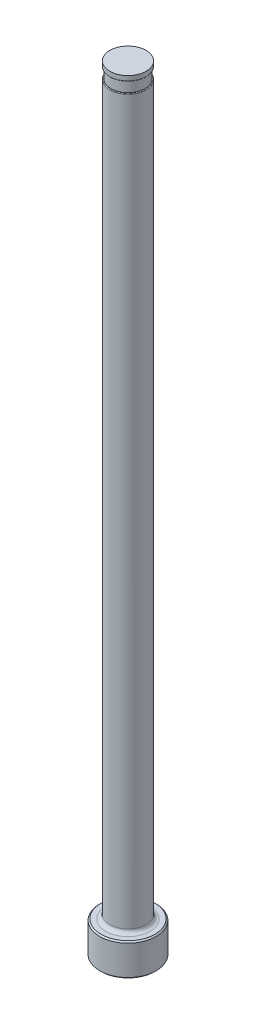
ISO-10303-21;
HEADER;
FILE_DESCRIPTION(('STEP AP214'),'2;1');
FILE_NAME('part.step','',(''),(''),'','','');
FILE_SCHEMA(('AUTOMOTIVE_DESIGN { 1 0 10303 214 1 1 1 1 }'));
ENDSEC;
DATA;
#1=APPLICATION_CONTEXT('core data for automotive mechanical design processes');
#2=APPLICATION_PROTOCOL_DEFINITION('international standard','automotive_design',2000,#1);
#3=PRODUCT_CONTEXT('',#1,'mechanical');
#4=PRODUCT('Part','Part','',(#3));
#5=PRODUCT_RELATED_PRODUCT_CATEGORY('part','',(#4));
#6=PRODUCT_DEFINITION_FORMATION('','',#4);
#7=PRODUCT_DEFINITION_CONTEXT('part definition',#1,'design');
#8=PRODUCT_DEFINITION('design','',#6,#7);
#9=PRODUCT_DEFINITION_SHAPE('','',#8);
#10=(LENGTH_UNIT() NAMED_UNIT(*) SI_UNIT(.MILLI.,.METRE.));
#11=(NAMED_UNIT(*) PLANE_ANGLE_UNIT() SI_UNIT($,.RADIAN.));
#12=(NAMED_UNIT(*) SI_UNIT($,.STERADIAN.) SOLID_ANGLE_UNIT());
#13=UNCERTAINTY_MEASURE_WITH_UNIT(LENGTH_MEASURE(1.E-05),#10,'distance_accuracy_value','');
#14=(GEOMETRIC_REPRESENTATION_CONTEXT(3) GLOBAL_UNCERTAINTY_ASSIGNED_CONTEXT((#13)) GLOBAL_UNIT_ASSIGNED_CONTEXT((#10,
#11,#12)) REPRESENTATION_CONTEXT('',''));
#15=CARTESIAN_POINT('',(0.,0.,0.));
#16=DIRECTION('',(0.,0.,1.));
#17=DIRECTION('',(1.,0.,0.));
#18=AXIS2_PLACEMENT_3D('',#15,#16,#17);
#19=CARTESIAN_POINT('',(-3.57123999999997,151.384,0.));
#20=DIRECTION('',(0.,1.,0.));
#21=DIRECTION('',(0.,0.,1.));
#22=AXIS2_PLACEMENT_3D('',#19,#20,#21);
#23=PLANE('',#22);
#24=CARTESIAN_POINT('',(0.,151.384,0.));
#25=DIRECTION('',(0.,1.,0.));
#26=DIRECTION('',(0.,0.,1.));
#27=AXIS2_PLACEMENT_3D('',#24,#25,#26);
#28=CIRCLE('',#27,3.43915999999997);
#29=CARTESIAN_POINT('',(0.,151.384,3.43915999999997));
#30=VERTEX_POINT('',#29);
#31=EDGE_CURVE('E11',#30,#30,#28,.F.);
#32=ORIENTED_EDGE('',*,*,#31,.T.);
#33=EDGE_LOOP('',(#32));
#34=FACE_BOUND('',#33,.T.);
#35=CARTESIAN_POINT('',(0.,151.384,0.));
#36=DIRECTION('',(0.,1.,0.));
#37=DIRECTION('',(0.,0.,1.));
#38=AXIS2_PLACEMENT_3D('',#35,#36,#37);
#39=CIRCLE('',#38,3.36803999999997);
#40=CARTESIAN_POINT('',(0.,151.384,3.36803999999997));
#41=VERTEX_POINT('',#40);
#42=EDGE_CURVE('E78',#41,#41,#39,.T.);
#43=ORIENTED_EDGE('',*,*,#42,.T.);
#44=EDGE_LOOP('',(#43));
#45=FACE_BOUND('',#44,.T.);
#46=ADVANCED_FACE('F36',(#34,#45),#23,.F.);
#47=CARTESIAN_POINT('',(0.,259.958771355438,0.));
#48=DIRECTION('',(0.,1.,0.));
#49=DIRECTION('',(0.,0.,1.));
#50=AXIS2_PLACEMENT_3D('',#47,#48,#49);
#51=CYLINDRICAL_SURFACE('',#50,3.57123999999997);
#52=DIRECTION('',(0.,1.,0.));
#53=VECTOR('',#52,1.);
#54=CARTESIAN_POINT('',(-3.36803999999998,259.958771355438,-1.18746018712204));
#55=LINE('',#54,#53);
#56=CARTESIAN_POINT('',(-3.36803999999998,149.225,-1.18746018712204));
#57=VERTEX_POINT('',#56);
#58=CARTESIAN_POINT('',(-3.36803999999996,86.868,-1.1874601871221));
#59=VERTEX_POINT('',#58);
#60=EDGE_CURVE('E73',#57,#59,#55,.F.);
#61=ORIENTED_EDGE('',*,*,#60,.F.);
#62=CARTESIAN_POINT('',(0.,149.225,0.));
#63=DIRECTION('',(0.,-1.,0.));
#64=DIRECTION('',(0.,0.,-1.));
#65=AXIS2_PLACEMENT_3D('',#62,#63,#64);
#66=CIRCLE('',#65,3.57123999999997);
#67=CARTESIAN_POINT('',(-3.36803999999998,149.225,1.18746018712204));
#68=VERTEX_POINT('',#67);
#69=EDGE_CURVE('E51',#57,#68,#66,.T.);
#70=ORIENTED_EDGE('',*,*,#69,.T.);
#71=DIRECTION('',(0.,1.,0.));
#72=VECTOR('',#71,1.);
#73=CARTESIAN_POINT('',(-3.36803999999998,259.958771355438,1.18746018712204));
#74=LINE('',#73,#72);
#75=CARTESIAN_POINT('',(-3.36803999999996,86.868,1.18746018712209));
#76=VERTEX_POINT('',#75);
#77=EDGE_CURVE('E84',#76,#68,#74,.T.);
#78=ORIENTED_EDGE('',*,*,#77,.F.);
#79=CARTESIAN_POINT('',(-3.36803999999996,86.868,-1.1874601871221));
#80=CARTESIAN_POINT('',(-3.3680377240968,86.8376283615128,-1.18745959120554));
#81=CARTESIAN_POINT('',(-3.36847634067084,86.80727189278,-1.18622334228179));
#82=CARTESIAN_POINT('',(-3.37021067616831,86.7467876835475,-1.18128966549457));
#83=CARTESIAN_POINT('',(-3.37150629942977,86.7166599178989,-1.1775925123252));
#84=CARTESIAN_POINT('',(-3.37663245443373,86.6270705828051,-1.16285138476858));
#85=CARTESIAN_POINT('',(-3.38170254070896,86.5682347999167,-1.14815759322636));
#86=CARTESIAN_POINT('',(-3.39461112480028,86.4540784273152,-1.10940606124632));
#87=CARTESIAN_POINT('',(-3.40245035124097,86.3987587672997,-1.08534585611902));
#88=CARTESIAN_POINT('',(-3.42005737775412,86.2931328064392,-1.02851526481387));
#89=CARTESIAN_POINT('',(-3.42982508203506,86.2428262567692,-0.995745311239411));
#90=CARTESIAN_POINT('',(-3.45028756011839,86.1483803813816,-0.922345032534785));
#91=CARTESIAN_POINT('',(-3.4609842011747,86.1042539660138,-0.881698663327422));
#92=CARTESIAN_POINT('',(-3.482209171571,86.0231926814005,-0.793737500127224));
#93=CARTESIAN_POINT('',(-3.49273745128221,85.9862598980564,-0.746420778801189));
#94=CARTESIAN_POINT('',(-3.51307583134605,85.9186585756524,-0.644120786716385));
#95=CARTESIAN_POINT('',(-3.52283072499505,85.8883557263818,-0.58888518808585));
#96=CARTESIAN_POINT('',(-3.54010786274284,85.8366078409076,-0.474091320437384));
#97=CARTESIAN_POINT('',(-3.54762954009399,85.8151650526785,-0.414531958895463));
#98=CARTESIAN_POINT('',(-3.56012114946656,85.7802555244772,-0.288969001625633));
#99=CARTESIAN_POINT('',(-3.56491124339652,85.7673434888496,-0.222793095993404));
#100=CARTESIAN_POINT('',(-3.57075657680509,85.751655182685,-0.089080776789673));
#101=CARTESIAN_POINT('',(-3.57181063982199,85.748882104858,-0.0215439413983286));
#102=CARTESIAN_POINT('',(-3.57004535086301,85.7535778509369,0.115996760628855));
#103=CARTESIAN_POINT('',(-3.56706025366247,85.761484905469,0.185984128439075));
#104=CARTESIAN_POINT('',(-3.55722219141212,85.7883152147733,0.323545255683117));
#105=CARTESIAN_POINT('',(-3.55036911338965,85.8072387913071,0.39111894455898));
#106=CARTESIAN_POINT('',(-3.53356592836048,85.8558994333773,0.521506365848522));
#107=CARTESIAN_POINT('',(-3.52363012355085,85.8855866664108,0.584340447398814));
#108=CARTESIAN_POINT('',(-3.50178692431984,85.955455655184,0.703501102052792));
#109=CARTESIAN_POINT('',(-3.4898802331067,85.9956336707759,0.759829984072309));
#110=CARTESIAN_POINT('',(-3.46618365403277,86.0834388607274,0.861343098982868));
#111=CARTESIAN_POINT('',(-3.45441819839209,86.1305877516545,0.906946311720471));
#112=CARTESIAN_POINT('',(-3.4318469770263,86.2325334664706,0.988936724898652));
#113=CARTESIAN_POINT('',(-3.42104103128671,86.2873288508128,1.02532565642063));
#114=CARTESIAN_POINT('',(-3.40231953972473,86.3994535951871,1.08578170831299));
#115=CARTESIAN_POINT('',(-3.3942694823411,86.4564337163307,1.11045708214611));
#116=CARTESIAN_POINT('',(-3.38112795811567,86.5740270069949,1.14985485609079));
#117=CARTESIAN_POINT('',(-3.37603276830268,86.6346354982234,1.16458978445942));
#118=CARTESIAN_POINT('',(-3.37115526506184,86.7245050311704,1.17859463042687));
#119=CARTESIAN_POINT('',(-3.36998926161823,86.7531157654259,1.18192009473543));
#120=CARTESIAN_POINT('',(-3.36843159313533,86.8104795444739,1.18635035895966));
#121=CARTESIAN_POINT('',(-3.36803858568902,86.8392322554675,1.18745900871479));
#122=CARTESIAN_POINT('',(-3.36803999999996,86.868,1.1874601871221));
#123=B_SPLINE_CURVE_WITH_KNOTS('',3,(#79,#80,#81,#82,#83,#84,#85,#86,#87,#88,#89,#90,#91,#92,
#93,#94,#95,#96,#97,#98,#99,#100,#101,#102,#103,#104,#105,#106,#107,#108,#109,#110,#111,#112,
#113,#114,#115,#116,#117,#118,#119,#120,#121,#122),.UNSPECIFIED.,.F.,.F.,(4,2,2,2,2,2,2,2,2,2,2,
2,2,2,2,2,2,2,2,2,2,4),(0.,0.0910565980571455,0.182103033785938,0.363698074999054,
0.545340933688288,0.726974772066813,0.908982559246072,1.09104304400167,1.28146671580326,
1.4719386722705,1.67381993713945,1.8757647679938,2.08625256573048,2.29674651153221,
2.5062781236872,2.71573513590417,2.9146211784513,3.11346982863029,3.30038893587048,
3.48707202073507,3.57347157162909,3.65972094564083),.UNSPECIFIED.);
#124=EDGE_CURVE('E81',#59,#76,#123,.T.);
#125=ORIENTED_EDGE('',*,*,#124,.F.);
#126=EDGE_LOOP('',(#61,#70,#78,#125));
#127=FACE_BOUND('',#126,.T.);
#128=CARTESIAN_POINT('',(0.,7.11200000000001,0.));
#129=DIRECTION('',(0.,1.,0.));
#130=DIRECTION('',(0.,0.,1.));
#131=AXIS2_PLACEMENT_3D('',#128,#129,#130);
#132=CIRCLE('',#131,3.57123999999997);
#133=CARTESIAN_POINT('',(0.,7.11200000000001,3.57123999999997));
#134=VERTEX_POINT('',#133);
#135=EDGE_CURVE('E116',#134,#134,#132,.T.);
#136=ORIENTED_EDGE('',*,*,#135,.T.);
#137=EDGE_LOOP('',(#136));
#138=FACE_BOUND('',#137,.T.);
#139=ADVANCED_FACE('F82',(#127,#138),#51,.T.);
#140=CARTESIAN_POINT('',(0.,0.,0.));
#141=DIRECTION('',(0.,-1.,0.));
#142=DIRECTION('',(0.,0.,-1.));
#143=AXIS2_PLACEMENT_3D('',#140,#141,#142);
#144=PLANE('',#143);
#145=CARTESIAN_POINT('',(0.,0.,0.));
#146=DIRECTION('',(0.,-1.,0.));
#147=DIRECTION('',(0.,0.,-1.));
#148=AXIS2_PLACEMENT_3D('',#145,#146,#147);
#149=CIRCLE('',#148,5.29589999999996);
#150=CARTESIAN_POINT('',(0.,0.,-5.29589999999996));
#151=VERTEX_POINT('',#150);
#152=EDGE_CURVE('E113',#151,#151,#149,.T.);
#153=ORIENTED_EDGE('',*,*,#152,.T.);
#154=EDGE_LOOP('',(#153));
#155=FACE_BOUND('',#154,.T.);
#156=ADVANCED_FACE('F192',(#155),#144,.T.);
#157=CARTESIAN_POINT('',(0.,259.958771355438,0.));
#158=DIRECTION('',(0.,1.,0.));
#159=DIRECTION('',(0.,0.,1.));
#160=AXIS2_PLACEMENT_3D('',#157,#158,#159);
#161=CYLINDRICAL_SURFACE('',#160,5.54989999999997);
#162=CARTESIAN_POINT('',(0.,6.09599999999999,0.));
#163=DIRECTION('',(0.,1.,0.));
#164=DIRECTION('',(0.,0.,1.));
#165=AXIS2_PLACEMENT_3D('',#162,#163,#164);
#166=CIRCLE('',#165,5.54989999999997);
#167=CARTESIAN_POINT('',(0.,6.09599999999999,5.54989999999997));
#168=VERTEX_POINT('',#167);
#169=EDGE_CURVE('E110',#168,#168,#166,.F.);
#170=ORIENTED_EDGE('',*,*,#169,.T.);
#171=EDGE_LOOP('',(#170));
#172=FACE_BOUND('',#171,.T.);
#173=CARTESIAN_POINT('',(0.,0.253999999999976,0.));
#174=DIRECTION('',(0.,-1.,0.));
#175=DIRECTION('',(0.,0.,-1.));
#176=AXIS2_PLACEMENT_3D('',#173,#174,#175);
#177=CIRCLE('',#176,5.54989999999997);
#178=CARTESIAN_POINT('',(0.,0.253999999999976,-5.54989999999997));
#179=VERTEX_POINT('',#178);
#180=EDGE_CURVE('E107',#179,#179,#177,.F.);
#181=ORIENTED_EDGE('',*,*,#180,.T.);
#182=EDGE_LOOP('',(#181));
#183=FACE_BOUND('',#182,.T.);
#184=ADVANCED_FACE('F195',(#172,#183),#161,.T.);
#185=CARTESIAN_POINT('',(-5.54989999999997,6.35,0.));
#186=DIRECTION('',(0.,1.,0.));
#187=DIRECTION('',(0.,0.,1.));
#188=AXIS2_PLACEMENT_3D('',#185,#186,#187);
#189=PLANE('',#188);
#190=CARTESIAN_POINT('',(0.,6.35,0.));
#191=DIRECTION('',(0.,1.,0.));
#192=DIRECTION('',(0.,0.,1.));
#193=AXIS2_PLACEMENT_3D('',#190,#191,#192);
#194=CIRCLE('',#193,4.33323999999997);
#195=CARTESIAN_POINT('',(0.,6.35,4.33323999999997));
#196=VERTEX_POINT('',#195);
#197=EDGE_CURVE('E87',#196,#196,#194,.F.);
#198=ORIENTED_EDGE('',*,*,#197,.T.);
#199=EDGE_LOOP('',(#198));
#200=FACE_BOUND('',#199,.T.);
#201=CARTESIAN_POINT('',(0.,6.35,0.));
#202=DIRECTION('',(0.,1.,0.));
#203=DIRECTION('',(0.,0.,1.));
#204=AXIS2_PLACEMENT_3D('',#201,#202,#203);
#205=CIRCLE('',#204,5.29589999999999);
#206=CARTESIAN_POINT('',(0.,6.35,5.29589999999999));
#207=VERTEX_POINT('',#206);
#208=EDGE_CURVE('E104',#207,#207,#205,.T.);
#209=ORIENTED_EDGE('',*,*,#208,.T.);
#210=EDGE_LOOP('',(#209));
#211=FACE_BOUND('',#210,.T.);
#212=ADVANCED_FACE('F190',(#200,#211),#189,.T.);
#213=CARTESIAN_POINT('',(0.,6.35000000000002,0.));
#214=DIRECTION('',(0.,-1.,0.));
#215=DIRECTION('',(0.,0.,-1.));
#216=AXIS2_PLACEMENT_3D('',#213,#214,#215);
#217=CONICAL_SURFACE('',#216,5.29589999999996,0.785398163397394);
#218=ORIENTED_EDGE('',*,*,#169,.F.);
#219=EDGE_LOOP('',(#218));
#220=FACE_BOUND('',#219,.T.);
#221=ORIENTED_EDGE('',*,*,#208,.F.);
#222=EDGE_LOOP('',(#221));
#223=FACE_BOUND('',#222,.T.);
#224=ADVANCED_FACE('F186',(#220,#223),#217,.T.);
#225=CARTESIAN_POINT('',(0.,0.253999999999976,0.));
#226=DIRECTION('',(0.,1.,0.));
#227=DIRECTION('',(0.,0.,1.));
#228=AXIS2_PLACEMENT_3D('',#225,#226,#227);
#229=CONICAL_SURFACE('',#228,5.54989999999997,0.785398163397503);
#230=ORIENTED_EDGE('',*,*,#152,.F.);
#231=EDGE_LOOP('',(#230));
#232=FACE_BOUND('',#231,.T.);
#233=ORIENTED_EDGE('',*,*,#180,.F.);
#234=EDGE_LOOP('',(#233));
#235=FACE_BOUND('',#234,.T.);
#236=ADVANCED_FACE('F182',(#232,#235),#229,.T.);
#237=CARTESIAN_POINT('',(0.,7.11200000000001,0.));
#238=DIRECTION('',(0.,1.,0.));
#239=DIRECTION('',(0.,0.,1.));
#240=AXIS2_PLACEMENT_3D('',#237,#238,#239);
#241=TOROIDAL_SURFACE('',#240,4.33323999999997,0.762);
#242=ORIENTED_EDGE('',*,*,#197,.F.);
#243=EDGE_LOOP('',(#242));
#244=FACE_BOUND('',#243,.T.);
#245=ORIENTED_EDGE('',*,*,#135,.F.);
#246=EDGE_LOOP('',(#245));
#247=FACE_BOUND('',#246,.T.);
#248=ADVANCED_FACE('F147',(#244,#247),#241,.F.);
#249=CARTESIAN_POINT('',(-3.57123999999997,149.352,0.));
#250=DIRECTION('',(0.,-1.,0.));
#251=DIRECTION('',(0.,0.,-1.));
#252=AXIS2_PLACEMENT_3D('',#249,#250,#251);
#253=PLANE('',#252);
#254=DIRECTION('',(0.,0.,1.));
#255=VECTOR('',#254,1.);
#256=CARTESIAN_POINT('',(-3.36803999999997,149.352,0.));
#257=LINE('',#256,#255);
#258=CARTESIAN_POINT('',(-3.36803999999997,149.352,0.));
#259=VERTEX_POINT('',#258);
#260=CARTESIAN_POINT('',(-3.36803999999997,149.352,0.720482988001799));
#261=VERTEX_POINT('',#260);
#262=EDGE_CURVE('E90',#259,#261,#257,.T.);
#263=ORIENTED_EDGE('',*,*,#262,.T.);
#264=CARTESIAN_POINT('',(0.,149.352,0.));
#265=DIRECTION('',(0.,-1.,0.));
#266=DIRECTION('',(0.,0.,-1.));
#267=AXIS2_PLACEMENT_3D('',#264,#265,#266);
#268=CIRCLE('',#267,3.44423999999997);
#269=CARTESIAN_POINT('',(-3.36803999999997,149.352,-0.720482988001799));
#270=VERTEX_POINT('',#269);
#271=EDGE_CURVE('E86',#261,#270,#268,.F.);
#272=ORIENTED_EDGE('',*,*,#271,.T.);
#273=EDGE_CURVE('E79',#270,#259,#257,.T.);
#274=ORIENTED_EDGE('',*,*,#273,.T.);
#275=CARTESIAN_POINT('',(0.,149.352,0.));
#276=DIRECTION('',(0.,1.,0.));
#277=DIRECTION('',(0.,0.,1.));
#278=AXIS2_PLACEMENT_3D('',#275,#276,#277);
#279=CIRCLE('',#278,3.36803999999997);
#280=EDGE_CURVE('E101',#259,#259,#279,.T.);
#281=ORIENTED_EDGE('',*,*,#280,.F.);
#282=EDGE_LOOP('',(#263,#272,#274,#281));
#283=FACE_BOUND('',#282,.T.);
#284=ADVANCED_FACE('F144',(#283),#253,.F.);
#285=CARTESIAN_POINT('',(0.,153.448281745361,0.));
#286=DIRECTION('',(0.,1.,0.));
#287=DIRECTION('',(0.,0.,1.));
#288=AXIS2_PLACEMENT_3D('',#285,#286,#287);
#289=CYLINDRICAL_SURFACE('',#288,3.36803999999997);
#290=ORIENTED_EDGE('',*,*,#42,.F.);
#291=EDGE_LOOP('',(#290));
#292=FACE_BOUND('',#291,.T.);
#293=ORIENTED_EDGE('',*,*,#280,.T.);
#294=EDGE_LOOP('',(#293));
#295=FACE_BOUND('',#294,.T.);
#296=ADVANCED_FACE('F141',(#292,#295),#289,.T.);
#297=CARTESIAN_POINT('',(-3.36803999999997,150.368,-5.54989999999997));
#298=DIRECTION('',(1.,0.,0.));
#299=DIRECTION('',(0.,1.,0.));
#300=AXIS2_PLACEMENT_3D('',#297,#298,#299);
#301=PLANE('',#300);
#302=ORIENTED_EDGE('',*,*,#273,.F.);
#303=CARTESIAN_POINT('',(-3.36803999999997,149.352,-0.720482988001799));
#304=CARTESIAN_POINT('',(-3.36803999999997,149.351993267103,-0.741667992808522));
#305=CARTESIAN_POINT('',(-3.36803999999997,149.351767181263,-0.762857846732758));
#306=CARTESIAN_POINT('',(-3.36803999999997,149.35071621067,-0.805256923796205));
#307=CARTESIAN_POINT('',(-3.36803999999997,149.349890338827,-0.826466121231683));
#308=CARTESIAN_POINT('',(-3.36803999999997,149.347476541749,-0.868880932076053));
#309=CARTESIAN_POINT('',(-3.36803999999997,149.345887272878,-0.890086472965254));
#310=CARTESIAN_POINT('',(-3.36803999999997,149.341714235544,-0.93239051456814));
#311=CARTESIAN_POINT('',(-3.36803999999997,149.339131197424,-0.953489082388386));
#312=CARTESIAN_POINT('',(-3.36803999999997,149.333919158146,-0.987044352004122));
#313=CARTESIAN_POINT('',(-3.36803999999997,149.331725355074,-0.999568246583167));
#314=CARTESIAN_POINT('',(-3.36803999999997,149.326729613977,-1.02450849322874));
#315=CARTESIAN_POINT('',(-3.36803999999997,149.32392716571,-1.03692474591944));
#316=CARTESIAN_POINT('',(-3.36803999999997,149.317430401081,-1.06198397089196));
#317=CARTESIAN_POINT('',(-3.36803999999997,149.313708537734,-1.07461988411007));
#318=CARTESIAN_POINT('',(-3.36803999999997,149.305125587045,-1.09949809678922));
#319=CARTESIAN_POINT('',(-3.36803999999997,149.300266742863,-1.1117411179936));
#320=CARTESIAN_POINT('',(-3.36803999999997,149.291811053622,-1.12921604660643));
#321=CARTESIAN_POINT('',(-3.36803999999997,149.28888164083,-1.13476833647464));
#322=CARTESIAN_POINT('',(-3.36803999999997,149.282508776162,-1.14558508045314));
#323=CARTESIAN_POINT('',(-3.36803999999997,149.279064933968,-1.15084931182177));
#324=CARTESIAN_POINT('',(-3.36803999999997,149.272291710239,-1.15984658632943));
#325=CARTESIAN_POINT('',(-3.36803999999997,149.269085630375,-1.1636712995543));
#326=CARTESIAN_POINT('',(-3.36803999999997,149.262150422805,-1.17081956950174));
#327=CARTESIAN_POINT('',(-3.36803999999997,149.258422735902,-1.1741444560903));
#328=CARTESIAN_POINT('',(-3.36803999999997,149.252066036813,-1.17872666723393));
#329=CARTESIAN_POINT('',(-3.36803999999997,149.249640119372,-1.1802633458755));
#330=CARTESIAN_POINT('',(-3.36803999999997,149.244593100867,-1.18295888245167));
#331=CARTESIAN_POINT('',(-3.36803999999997,149.241972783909,-1.18411916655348));
#332=CARTESIAN_POINT('',(-3.36803999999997,149.236986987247,-1.18581641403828));
#333=CARTESIAN_POINT('',(-3.36803999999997,149.234645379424,-1.18642231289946));
#334=CARTESIAN_POINT('',(-3.36803999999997,149.229871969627,-1.18724906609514));
#335=CARTESIAN_POINT('',(-3.36803999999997,149.227439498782,-1.18746599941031));
#336=CARTESIAN_POINT('',(-3.36803999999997,149.225,-1.18746018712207));
#337=B_SPLINE_CURVE_WITH_KNOTS('',3,(#303,#304,#305,#306,#307,#308,#309,#310,#311,#312,#313,
#314,#315,#316,#317,#318,#319,#320,#321,#322,#323,#324,#325,#326,#327,#328,#329,#330,#331,#332,
#333,#334,#335,#336),.UNSPECIFIED.,.F.,.F.,(4,2,2,2,2,2,2,2,2,2,2,2,2,2,2,2,4),(0.,
0.0635614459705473,0.127227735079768,0.191006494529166,0.254738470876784,0.292871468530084,
0.331036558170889,0.370524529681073,0.409935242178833,0.428750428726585,0.447579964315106,
0.462519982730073,0.477419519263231,0.486010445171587,0.494568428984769,0.501793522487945,
0.509091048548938),.UNSPECIFIED.);
#338=EDGE_CURVE('E59',#270,#57,#337,.T.);
#339=ORIENTED_EDGE('',*,*,#338,.T.);
#340=ORIENTED_EDGE('',*,*,#60,.T.);
#341=DIRECTION('',(0.,0.,1.));
#342=VECTOR('',#341,1.);
#343=CARTESIAN_POINT('',(-3.36803999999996,86.868,-5.54989999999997));
#344=LINE('',#343,#342);
#345=EDGE_CURVE('E77',#59,#76,#344,.T.);
#346=ORIENTED_EDGE('',*,*,#345,.T.);
#347=ORIENTED_EDGE('',*,*,#77,.T.);
#348=CARTESIAN_POINT('',(-3.36803999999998,149.225,1.18746018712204));
#349=CARTESIAN_POINT('',(-3.36803999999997,149.227718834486,1.18746847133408));
#350=CARTESIAN_POINT('',(-3.36803999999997,149.230426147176,1.18719803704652));
#351=CARTESIAN_POINT('',(-3.36803999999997,149.235714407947,1.18617805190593));
#352=CARTESIAN_POINT('',(-3.36803999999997,149.238296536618,1.18543473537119));
#353=CARTESIAN_POINT('',(-3.36803999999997,149.243910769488,1.18331500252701));
#354=CARTESIAN_POINT('',(-3.36803999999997,149.246900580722,1.18182891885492));
#355=CARTESIAN_POINT('',(-3.36803999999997,149.252613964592,1.17839592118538));
#356=CARTESIAN_POINT('',(-3.36803999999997,149.25533604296,1.17644660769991));
#357=CARTESIAN_POINT('',(-3.36803999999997,149.26227895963,1.17078841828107));
#358=CARTESIAN_POINT('',(-3.36803999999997,149.266257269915,1.16678561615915));
#359=CARTESIAN_POINT('',(-3.36803999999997,149.273603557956,1.15826505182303));
#360=CARTESIAN_POINT('',(-3.36803999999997,149.27697020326,1.15374619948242));
#361=CARTESIAN_POINT('',(-3.36803999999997,149.288637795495,1.13637607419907));
#362=CARTESIAN_POINT('',(-3.36803999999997,149.29546833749,1.1225589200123));
#363=CARTESIAN_POINT('',(-3.36803999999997,149.307284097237,1.09405878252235));
#364=CARTESIAN_POINT('',(-3.36803999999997,149.312244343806,1.07936692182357));
#365=CARTESIAN_POINT('',(-3.36803999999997,149.32078105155,1.04990009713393));
#366=CARTESIAN_POINT('',(-3.36803999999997,149.324383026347,1.03513257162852));
#367=CARTESIAN_POINT('',(-3.36803999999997,149.330680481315,1.00540216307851));
#368=CARTESIAN_POINT('',(-3.36803999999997,149.333375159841,0.990439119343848));
#369=CARTESIAN_POINT('',(-3.36803999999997,149.340439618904,0.945273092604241));
#370=CARTESIAN_POINT('',(-3.36803999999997,149.343761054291,0.914907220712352));
#371=CARTESIAN_POINT('',(-3.36803999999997,149.348361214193,0.857080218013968));
#372=CARTESIAN_POINT('',(-3.36803999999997,149.3498100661,0.829630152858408));
#373=CARTESIAN_POINT('',(-3.36803999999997,149.351615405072,0.77494452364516));
#374=CARTESIAN_POINT('',(-3.36803999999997,149.351981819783,0.747709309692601));
#375=CARTESIAN_POINT('',(-3.36803999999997,149.352,0.720482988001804));
#376=B_SPLINE_CURVE_WITH_KNOTS('',3,(#348,#349,#350,#351,#352,#353,#354,#355,#356,#357,#358,
#359,#360,#361,#362,#363,#364,#365,#366,#367,#368,#369,#370,#371,#372,#373,#374,#375),
.UNSPECIFIED.,.F.,.F.,(4,2,2,2,2,2,2,2,2,2,2,2,2,4),(0.,0.00812455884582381,0.0161441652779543,
0.0261041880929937,0.0361169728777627,0.0529520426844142,0.0698233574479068,0.115707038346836,
0.162183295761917,0.20773700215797,0.253330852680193,0.34486973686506,0.42731634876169,
0.509004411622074),.UNSPECIFIED.);
#377=EDGE_CURVE('E172',#68,#261,#376,.T.);
#378=ORIENTED_EDGE('',*,*,#377,.T.);
#379=ORIENTED_EDGE('',*,*,#262,.F.);
#380=EDGE_LOOP('',(#302,#339,#340,#346,#347,#378,#379));
#381=FACE_BOUND('',#380,.T.);
#382=ADVANCED_FACE('F75',(#381),#301,.F.);
#383=CARTESIAN_POINT('',(-6.54303999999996,86.868,-5.54989999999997));
#384=DIRECTION('',(0.,0.,1.));
#385=DIRECTION('',(1.,0.,0.));
#386=AXIS2_PLACEMENT_3D('',#383,#384,#385);
#387=CYLINDRICAL_SURFACE('',#386,3.175);
#388=ORIENTED_EDGE('',*,*,#345,.F.);
#389=ORIENTED_EDGE('',*,*,#124,.T.);
#390=EDGE_LOOP('',(#388,#389));
#391=FACE_BOUND('',#390,.T.);
#392=ADVANCED_FACE('F89',(#391),#387,.F.);
#393=CARTESIAN_POINT('',(0.,152.687735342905,0.));
#394=DIRECTION('',(0.,1.,0.));
#395=DIRECTION('',(0.,0.,1.));
#396=AXIS2_PLACEMENT_3D('',#393,#394,#395);
#397=CYLINDRICAL_SURFACE('',#396,3.56615999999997);
#398=CARTESIAN_POINT('',(0.,151.511,0.));
#399=DIRECTION('',(0.,1.,0.));
#400=DIRECTION('',(0.,0.,1.));
#401=AXIS2_PLACEMENT_3D('',#398,#399,#400);
#402=CIRCLE('',#401,3.56615999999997);
#403=CARTESIAN_POINT('',(0.,151.511,3.56615999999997));
#404=VERTEX_POINT('',#403);
#405=EDGE_CURVE('E44',#404,#404,#402,.T.);
#406=ORIENTED_EDGE('',*,*,#405,.T.);
#407=EDGE_LOOP('',(#406));
#408=FACE_BOUND('',#407,.T.);
#409=CARTESIAN_POINT('',(0.,152.4,0.));
#410=DIRECTION('',(0.,1.,0.));
#411=DIRECTION('',(0.,0.,1.));
#412=AXIS2_PLACEMENT_3D('',#409,#410,#411);
#413=CIRCLE('',#412,3.56615999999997);
#414=CARTESIAN_POINT('',(0.,152.4,3.56615999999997));
#415=VERTEX_POINT('',#414);
#416=EDGE_CURVE('E91',#415,#415,#413,.T.);
#417=ORIENTED_EDGE('',*,*,#416,.F.);
#418=EDGE_LOOP('',(#417));
#419=FACE_BOUND('',#418,.T.);
#420=ADVANCED_FACE('F135',(#408,#419),#397,.T.);
#421=CARTESIAN_POINT('',(-3.57123999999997,152.4,0.));
#422=DIRECTION('',(0.,1.,0.));
#423=DIRECTION('',(0.,0.,1.));
#424=AXIS2_PLACEMENT_3D('',#421,#422,#423);
#425=PLANE('',#424);
#426=ORIENTED_EDGE('',*,*,#416,.T.);
#427=EDGE_LOOP('',(#426));
#428=FACE_BOUND('',#427,.T.);
#429=ADVANCED_FACE('F149',(#428),#425,.T.);
#430=CARTESIAN_POINT('',(0.,149.225,0.));
#431=DIRECTION('',(0.,-1.,0.));
#432=DIRECTION('',(0.,0.,-1.));
#433=AXIS2_PLACEMENT_3D('',#430,#431,#432);
#434=TOROIDAL_SURFACE('',#433,3.44423999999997,0.127);
#435=ORIENTED_EDGE('',*,*,#377,.F.);
#436=ORIENTED_EDGE('',*,*,#69,.F.);
#437=ORIENTED_EDGE('',*,*,#338,.F.);
#438=ORIENTED_EDGE('',*,*,#271,.F.);
#439=EDGE_LOOP('',(#435,#436,#437,#438));
#440=FACE_BOUND('',#439,.T.);
#441=ADVANCED_FACE('F151',(#440),#434,.T.);
#442=CARTESIAN_POINT('',(0.,151.511,0.));
#443=DIRECTION('',(0.,1.,0.));
#444=DIRECTION('',(0.,0.,1.));
#445=AXIS2_PLACEMENT_3D('',#442,#443,#444);
#446=TOROIDAL_SURFACE('',#445,3.43915999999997,0.127);
#447=ORIENTED_EDGE('',*,*,#31,.F.);
#448=EDGE_LOOP('',(#447));
#449=FACE_BOUND('',#448,.T.);
#450=ORIENTED_EDGE('',*,*,#405,.F.);
#451=EDGE_LOOP('',(#450));
#452=FACE_BOUND('',#451,.T.);
#453=ADVANCED_FACE('F38',(#449,#452),#446,.T.);
#454=CLOSED_SHELL('',(#46,#139,#156,#184,#212,#224,#236,#248,#284,#296,#382,#392,#420,#429,#441,#453));
#455=MANIFOLD_SOLID_BREP('B2',#454);
#456=ADVANCED_BREP_SHAPE_REPRESENTATION('',(#18,#455),#14);
#457=SHAPE_DEFINITION_REPRESENTATION(#9,#456);
ENDSEC;
END-ISO-10303-21;
